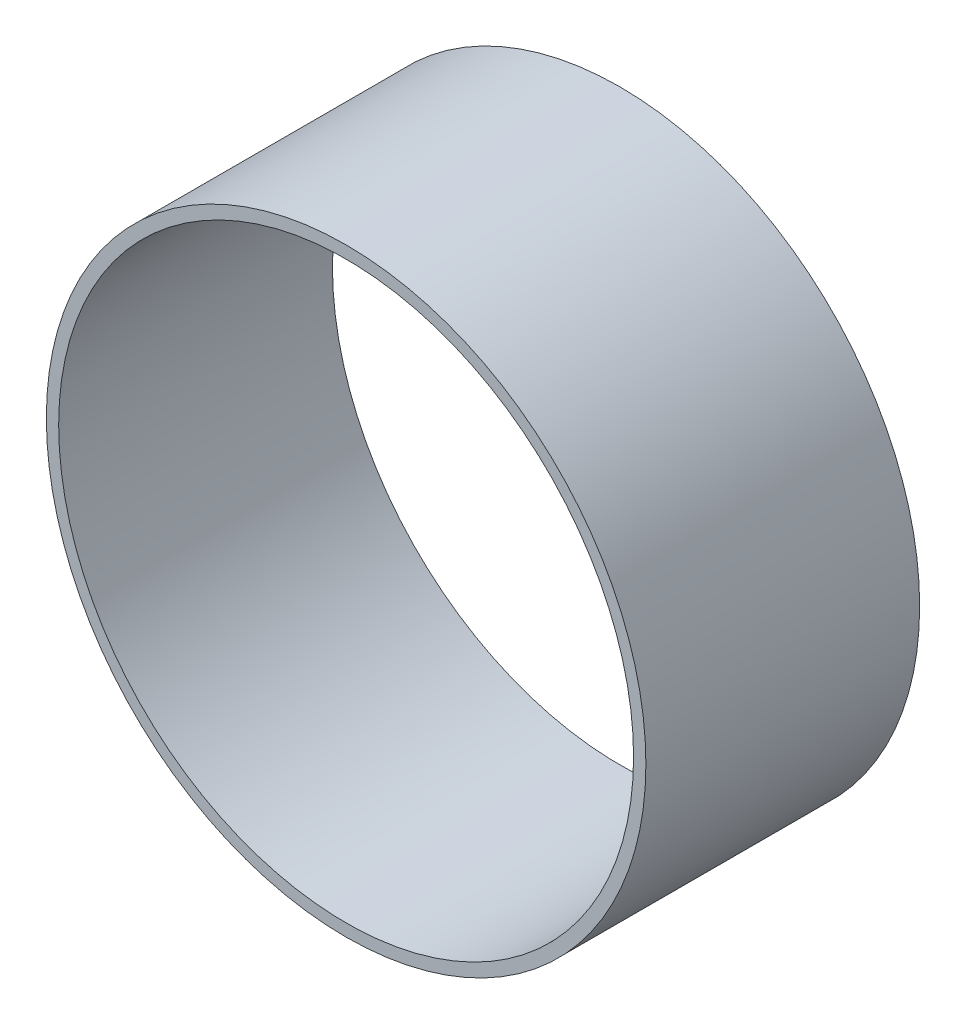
from build123d import *

# Parameters (mm, degrees)
SKIZZE1_R                    = 109.5
SKIZZE1_R_2                  = 105
BASIS_LINEAR_AUSTRAGEN_DEPTH = 100


with BuildPart() as part:
    # Skizze1 → Basis-Linear austragen (new body)
    with BuildSketch(Plane.XY):
        Circle(SKIZZE1_R)
        Circle(SKIZZE1_R_2, mode=Mode.SUBTRACT)
    extrude(amount=BASIS_LINEAR_AUSTRAGEN_DEPTH)


solid = part.part
